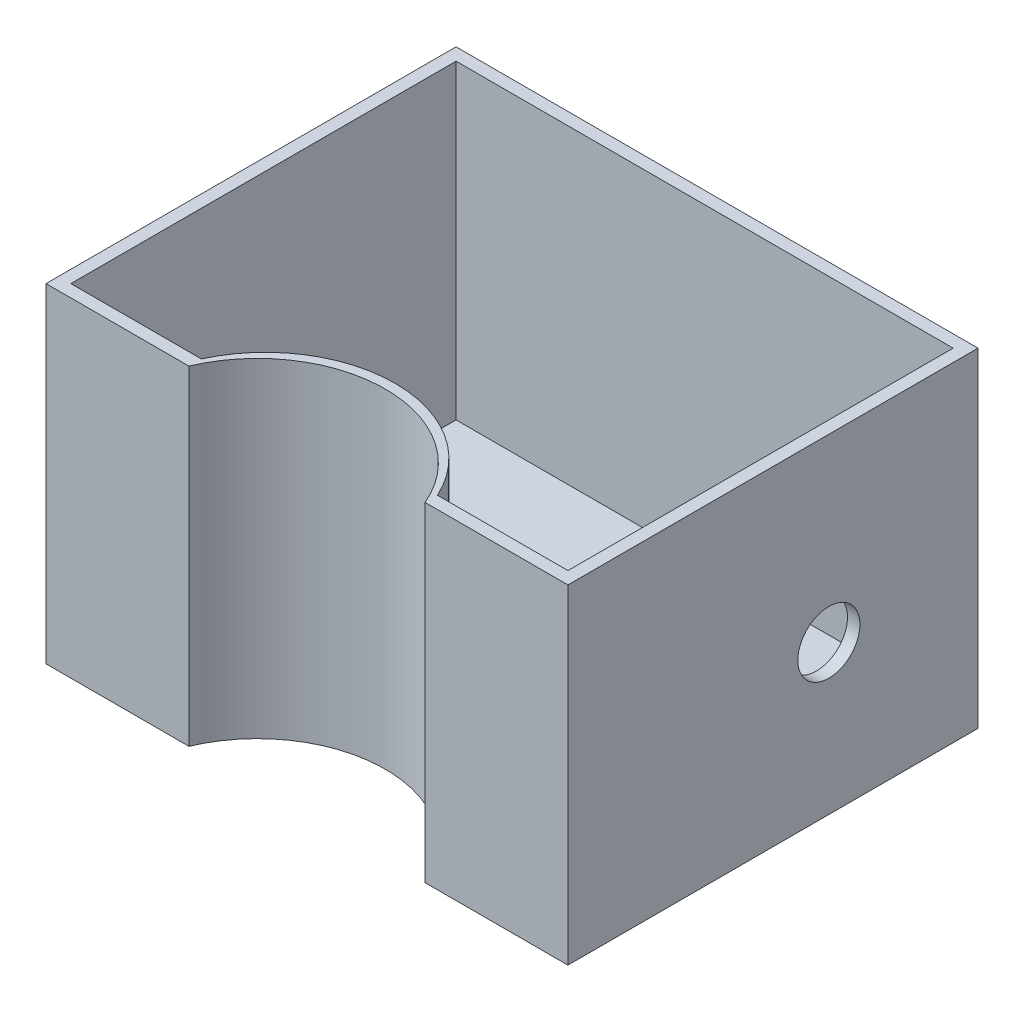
from build123d import *

# Parameters (mm, degrees)
BOSS_EXTRUDE6_DEPTH      = 50
BOSS_EXTRUDE6_DEPTH_BACK = 3
CUT_EXTRUDE11_DEPTH      = 50
SKETCH2_R                = 5
CUT_EXTRUDE15_DEPTH      = 116.41230437


with BuildPart() as part:
    # Sketch1 → Boss-Extrude6 (new, two sides: drawn at the far end of the back side and taken through both)
    with BuildSketch(Plane(origin=(0, 0, 0), x_dir=(1, 0, 0), z_dir=(0, 1, 0)).offset(-BOSS_EXTRUDE6_DEPTH_BACK)):
        with BuildLine():
            Line((-2, -2), (-2, 64))
            Line((-2, 64), (82, 64))
            Line((82, 64), (82, -2))
            Line((82, -2), (59, -2))
            ThreePointArc((59, -2), (40, 10.615528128), (21, -2))
            Line((21, -2), (-2, -2))
        make_face()
    extrude(amount=BOSS_EXTRUDE6_DEPTH + BOSS_EXTRUDE6_DEPTH_BACK)

    # Sketch1_13 → Cut-Extrude11 (cut)
    with BuildSketch(Plane(origin=(0, 0, 0), x_dir=(1, 0, 0), z_dir=(0, 1, 0))):
        with BuildLine():
            Line((0, 0), (21, 0))
            ThreePointArc((21, 0), (40, 12.19310618), (59, 0))
            Line((59, 0), (80, 0))
            Line((80, 0), (80, 62))
            Line((80, 62), (0, 62))
            Line((0, 62), (0, 0))
        make_face()
    extrude(amount=CUT_EXTRUDE11_DEPTH, mode=Mode.SUBTRACT)

    # Sketch2 → Cut-Extrude15 (cut, through all)
    with BuildSketch(Plane(origin=(0, 0, 0), x_dir=(0, 0, -1), z_dir=(1, 0, 0))):
        with Locations(Location((40, 21, 0), (0, 0, 180))):
            Circle(SKETCH2_R)
    extrude(amount=CUT_EXTRUDE15_DEPTH, mode=Mode.SUBTRACT)


solid = part.part
